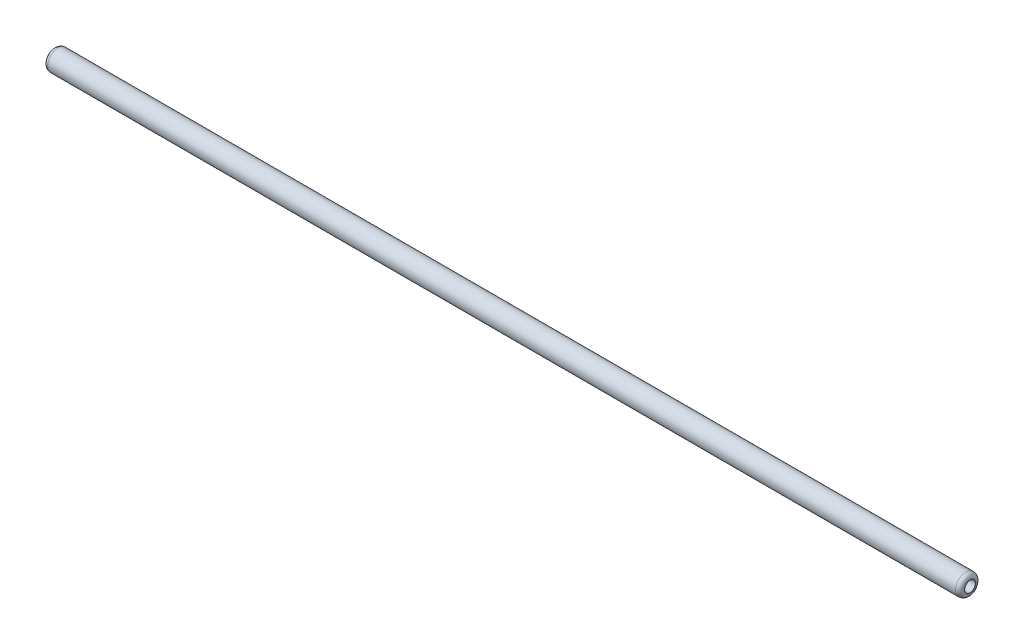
from build123d import *

# Parameters (mm, degrees)
SKETCH1_R                    = 6.35
BOSS_EXTRUDE1_DEPTH          = 558.8
F_5_16_18_TAPPED_HOLE1_D     = 6.5278
F_5_16_18_TAPPED_HOLE1_DEPTH = 31.75
F_5_16_18_TAPPED_HOLE1_TIP   = 1.961148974
FILLET1_R                    = 2.54
F_5_16_18_TAPPED_HOLE2_D     = 6.5278
F_5_16_18_TAPPED_HOLE2_DEPTH = 31.75
F_5_16_18_TAPPED_HOLE2_TIP   = 1.961148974


with BuildPart() as part:
    # Sketch1 → Boss-Extrude1 (new body)
    with BuildSketch(Plane(origin=(0, 0, 0), x_dir=(0, 0, -1), z_dir=(1, 0, 0))):
        Circle(SKETCH1_R)
    extrude(amount=BOSS_EXTRUDE1_DEPTH)

    # 5_16-18 Tapped Hole1
    with Locations(Plane.ZY):
        with Locations((0, 0)):
            Hole(F_5_16_18_TAPPED_HOLE1_D / 2, depth=F_5_16_18_TAPPED_HOLE1_DEPTH)
            with Locations((0, 0, -(F_5_16_18_TAPPED_HOLE1_DEPTH + F_5_16_18_TAPPED_HOLE1_TIP / 2))):  # 118° drill point
                Cone(0, F_5_16_18_TAPPED_HOLE1_D / 2, F_5_16_18_TAPPED_HOLE1_TIP, mode=Mode.SUBTRACT)

    # Fillet1
    fillet1_edges = [part.edges().sort_by_distance(p)[0] for p in [
        (0, 0, 6.35),
        (558.8, 0, 6.35),
    ]]
    fillet(fillet1_edges, radius=FILLET1_R)

    # 5_16-18 Tapped Hole2
    with Locations(Plane(origin=(558.8, 0, 0), x_dir=(0, 0, -1), z_dir=(1, 0, 0))):
        with Locations((0, 0)):
            Hole(F_5_16_18_TAPPED_HOLE2_D / 2, depth=F_5_16_18_TAPPED_HOLE2_DEPTH)
            with Locations((0, 0, -(F_5_16_18_TAPPED_HOLE2_DEPTH + F_5_16_18_TAPPED_HOLE2_TIP / 2))):  # 118° drill point
                Cone(0, F_5_16_18_TAPPED_HOLE2_D / 2, F_5_16_18_TAPPED_HOLE2_TIP, mode=Mode.SUBTRACT)


solid = part.part
